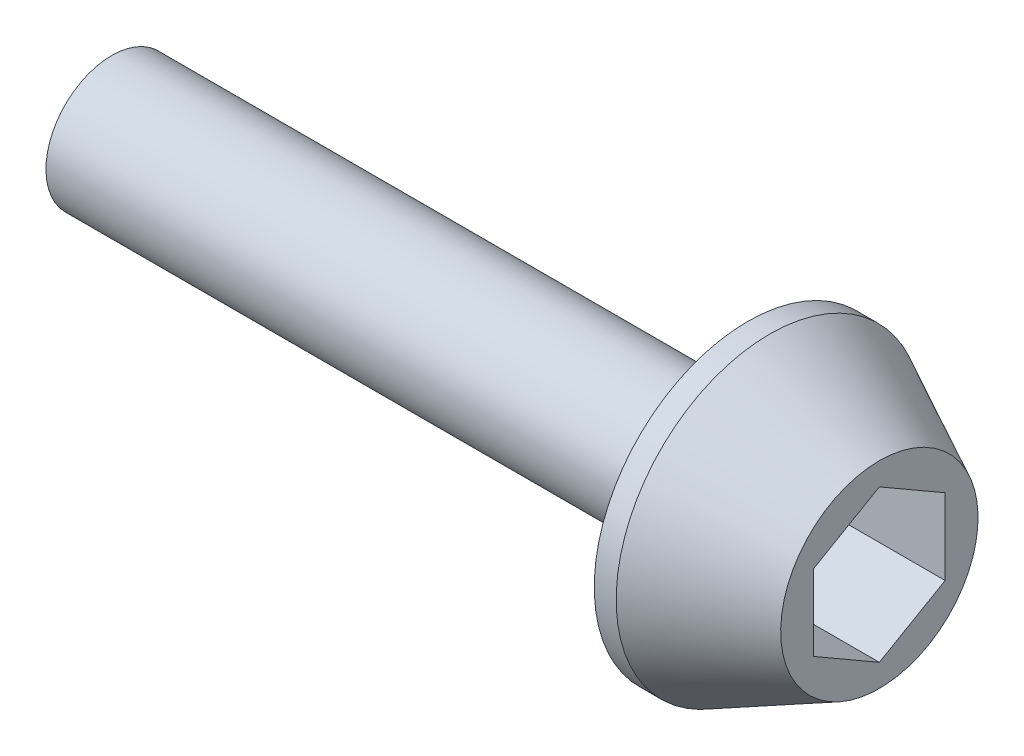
from build123d import *

# Parameters (mm, degrees)
CORTAR_EXTRUIR1_DEPTH = 5


with BuildPart() as part:
    # Croquis1 → Revoluci_n1 (revolve)
    with BuildSketch(Plane.XY):
        Polygon((0, 4.5), (0, 0), (-6, 0), (-6, 2), (-35, 2), (-35, 3), (-6, 3), (-6, 7), (-5, 7), align=None)
    revolve(axis=Axis((0, 0, 0), (-1, 0, 0)))

    # Croquis2 → Cortar-Extruir1 (cut)
    with BuildSketch(Plane(origin=(0, 0, 0), x_dir=(0, 0, -1), z_dir=(1, 0, 0))):
        Polygon((0, 3.464101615), (-3, 1.732050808), (-3, -1.732050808), (0, -3.464101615), (3, -1.732050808), (3, 1.732050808), align=None)
    extrude(amount=-CORTAR_EXTRUIR1_DEPTH, mode=Mode.SUBTRACT)


solid = part.part
